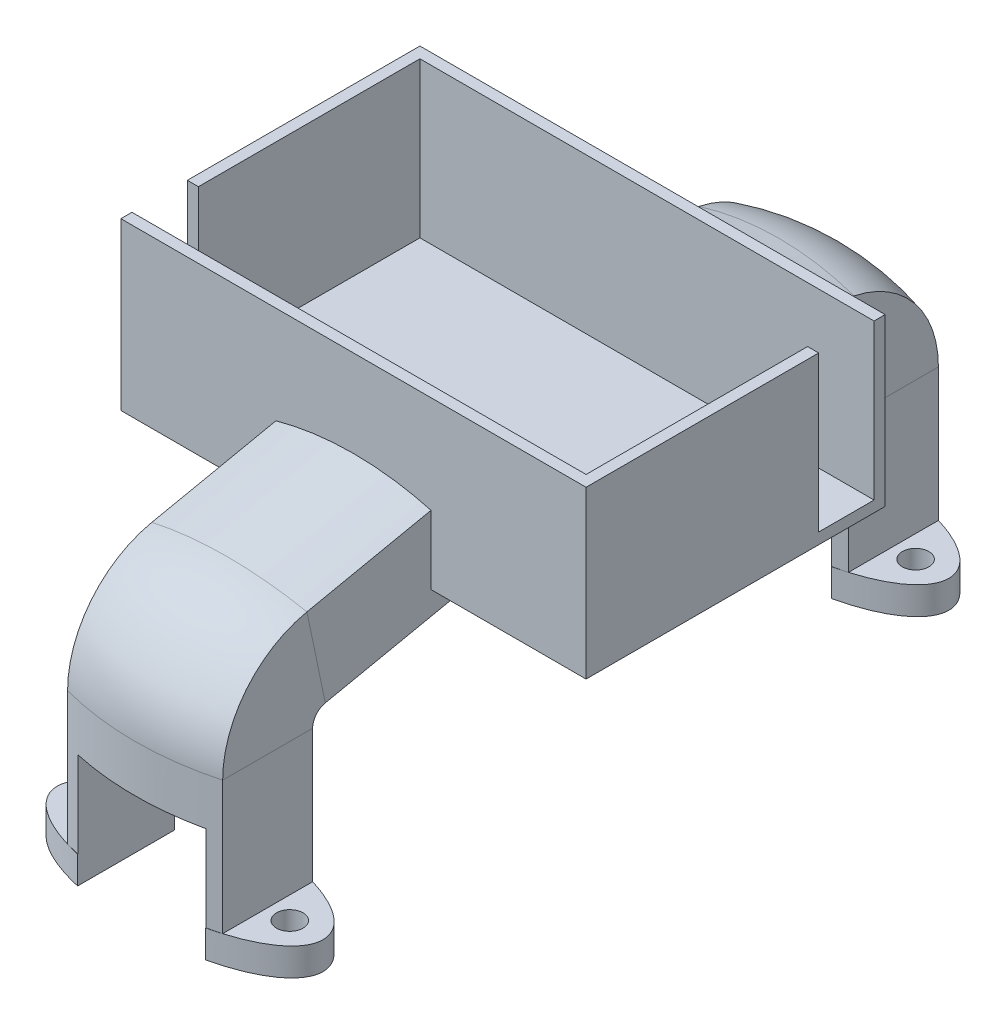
from build123d import *

# Parameters (mm, degrees)
SKETCH2_RX          = 12
SKETCH2_RY          = 5
BOSS_EXTRUDE1_DEPTH = 2.5
SKETCH3_R           = 1.2
CUT_EXTRUDE1_DEPTH  = 2.5
BOSS_EXTRUDE3_DEPTH = 9
SKETCH11_W          = 11.55
SKETCH11_H          = 10.25
CUT_EXTRUDE3_DEPTH  = 20
SKETCH12_RX         = 12
SKETCH12_RY         = 5
BOSS_EXTRUDE4_DEPTH = 2.5
SKETCH14_R          = 1.2
CUT_EXTRUDE4_DEPTH  = 2.5
BOSS_EXTRUDE5_DEPTH = 9
SKETCH17_W          = 42
SKETCH17_H          = 27
SKETCH17_W_2        = 40
SKETCH17_H_2        = 25
BOSS_EXTRUDE6_DEPTH = 15
SKETCH18_W          = 40
SKETCH18_H          = 25
BOSS_EXTRUDE7_DEPTH = 1.5
SKETCH19_W          = 11.55
SKETCH19_H          = 10.25
CUT_EXTRUDE5_DEPTH  = 13
SKETCH34_W          = 40
SKETCH34_H          = 25
CUT_EXTRUDE6_DEPTH  = 14
SKETCH35_W          = 1
SKETCH35_H          = 5
CUT_EXTRUDE7_DEPTH  = 14


with BuildPart() as part:
    # Sketch2 → Boss-Extrude1 (new body)
    with BuildSketch(Plane(origin=(0, 0, 0), x_dir=(1, 0, 0), z_dir=(0, 1, 0))):
        with Locations((0, 0)):
            Ellipse(SKETCH2_RX, SKETCH2_RY)
    extrude(amount=BOSS_EXTRUDE1_DEPTH)

    # Sketch3 → Cut-Extrude1 (cut)
    with BuildSketch(Plane(origin=(0, 2.5, 0), x_dir=(1, 0, 0), z_dir=(0, 1, 0))):
        with Locations(Location((9, 0, 0), (0, 0, 270))):
            Circle(SKETCH3_R)
        with Locations(Location((-9, 0, 0), (0, 0, 270))):
            Circle(SKETCH3_R)
    extrude(amount=-CUT_EXTRUDE1_DEPTH, mode=Mode.SUBTRACT)

    # Sketch10 → Boss-Extrude3 (add)
    with BuildSketch(Plane(origin=(0, 2.5, 0), x_dir=(1, 0, 0), z_dir=(0, 1, 0))):
        with BuildLine():
            Line((-7, -4.06116431), (-7, 4.06116431))
            ThreePointArc((-7, 4.06116431), (0, 4.987807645), (7, 4.06116431))
            Line((7, 4.06116431), (7, -4.06116431))
            ThreePointArc((7, -4.06116431), (0, -4.98780129), (-7, -4.06116431))
        make_face()
    extrude(amount=BOSS_EXTRUDE3_DEPTH)

    # Sketch11 → Cut-Extrude3 (cut)
    with BuildSketch(Plane.XY.offset(10)):
        with Locations((0, 5.125)):
            Rectangle(SKETCH11_W, SKETCH11_H)
    extrude(amount=-CUT_EXTRUDE3_DEPTH, mode=Mode.SUBTRACT)



with BuildPart() as body_2:
    # Sketch12 → Boss-Extrude4 (new body)
    with BuildSketch(Plane(origin=(0, 0, 0), x_dir=(1, 0, 0), z_dir=(0, 1, 0))):
        with Locations((0, 56.5)):
            Ellipse(SKETCH12_RX, SKETCH12_RY)
    extrude(amount=BOSS_EXTRUDE4_DEPTH)

    # Sketch14 → Cut-Extrude4 (cut)
    with BuildSketch(Plane(origin=(0, 2.5, 0), x_dir=(1, 0, 0), z_dir=(0, 1, 0))):
        with Locations(Location((9, 56.5, 0), (0, 0, 270))):
            Circle(SKETCH14_R)
        with Locations(Location((-9, 56.5, 0), (0, 0, 270))):
            Circle(SKETCH14_R)
    extrude(amount=-CUT_EXTRUDE4_DEPTH, mode=Mode.SUBTRACT)

    # Sketch16 → Boss-Extrude5 (add)
    with BuildSketch(Plane(origin=(0, 2.5, 0), x_dir=(1, 0, 0), z_dir=(0, 1, 0))):
        with BuildLine():
            Line((-7, 60.56116431), (-7, 52.43883569))
            ThreePointArc((-7, 52.43883569), (0, 51.499999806), (7, 52.43883569))
            Line((7, 52.43883569), (7, 60.56116431))
            ThreePointArc((7, 60.56116431), (0, 61.500000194), (-7, 60.56116431))
        make_face()
    extrude(amount=BOSS_EXTRUDE5_DEPTH)

    # Sketch19 → Cut-Extrude5 (cut)
    with BuildSketch(Plane.XY.offset(-50)):
        with Locations((0, 5.125)):
            Rectangle(SKETCH19_W, SKETCH19_H)
    extrude(amount=-CUT_EXTRUDE5_DEPTH, mode=Mode.SUBTRACT)



with BuildPart() as body_3:
    # Sketch17 → Boss-Extrude6 (new body)
    with BuildSketch(Plane(origin=(0, 20, 0), x_dir=(1, 0, 0), z_dir=(0, 1, 0))):
        with Locations((0, 28.25)):
            Rectangle(SKETCH17_W, SKETCH17_H)
        with Locations((0, 28.25)):
            Rectangle(SKETCH17_W_2, SKETCH17_H_2, mode=Mode.SUBTRACT)
    extrude(amount=BOSS_EXTRUDE6_DEPTH)

    # Sketch18 → Boss-Extrude7 (add)
    with BuildSketch(Plane(origin=(0, 20, 0), x_dir=(1, 0, 0), z_dir=(0, 1, 0))):
        with Locations((0, 28.25)):
            Rectangle(SKETCH18_W, SKETCH18_H)
    extrude(amount=BOSS_EXTRUDE7_DEPTH)


with BuildPart() as body_2_1:
    add(body_2.part)

    add(body_3.part)  # Sweep6 merges body 3
    # Sweep6: sweep along a path in Sketch21
    with BuildLine(Plane(origin=(0, 0, 0), x_dir=(0, 0, -1), z_dir=(1, 0, 0))) as sweep6_path:
        Line((56.5, 11.5), (56.5, 14.5))
        ThreePointArc((56.5, 14.5), (55.267760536, 17.969325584), (52.123192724, 19.884091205))
        Line((52.123192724, 19.884091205), (34.502530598, 23.559994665))
    # Sketch20 → Sweep6 (sweep)
    with BuildSketch(Plane(origin=(0, 11.5, 0), x_dir=(1, 0, 0), z_dir=(0, 1, 0))):
        with BuildLine():
            Line((-7, 60.56116431), (-7, 52.43883569))
            ThreePointArc((-7, 52.43883569), (0, 51.499999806), (7, 52.43883569))
            Line((7, 52.43883569), (7, 60.56116431))
            ThreePointArc((7, 60.56116431), (0, 61.500000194), (-7, 60.56116431))
        make_face()
    sweep(path=sweep6_path.line)


with BuildPart() as part_1:
    add(part.part)

    add(body_2_1.part)  # Sweep7 merges body 2
    # Sweep7: sweep along a path in Sketch33
    with BuildLine(Plane(origin=(0, 0, 0), x_dir=(0, 0, -1), z_dir=(1, 0, 0))) as sweep7_path:
        Line((21.997469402, 23.559994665), (4.376807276, 19.884091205))
        ThreePointArc((4.376807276, 19.884091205), (1.232239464, 17.969325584), (0, 14.5))
        Line((0, 14.5), (0, 11.5))
    # Sketch32 → Sweep7 (sweep)
    with BuildSketch(Plane(origin=(0, 11.5, 0), x_dir=(1, 0, 0), z_dir=(0, 1, 0))):
        with BuildLine():
            Line((-7, 4.06116431), (-7, -4.06116431))
            ThreePointArc((-7, -4.06116431), (0, -4.98780129), (7, -4.06116431))
            Line((7, -4.06116431), (7, 4.06116431))
            ThreePointArc((7, 4.06116431), (0, 4.987807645), (-7, 4.06116431))
        make_face()
    sweep(path=sweep7_path.line)

    # Sketch34 → Cut-Extrude6 (cut)
    with BuildSketch(Plane(origin=(0, 35, 0), x_dir=(1, 0, 0), z_dir=(0, 1, 0))):
        with Locations((0, 28.25)):
            Rectangle(SKETCH34_W, SKETCH34_H)
    extrude(amount=-CUT_EXTRUDE6_DEPTH, mode=Mode.SUBTRACT)

    # Sketch35 → Cut-Extrude7 (cut)
    with BuildSketch(Plane(origin=(0, 35, 0), x_dir=(1, 0, 0), z_dir=(0, 1, 0))):
        with Locations((-20.5, 18.25)):
            Rectangle(SKETCH35_W, SKETCH35_H)
        with Locations((20.5, 38.25)):
            Rectangle(SKETCH35_W, SKETCH35_H)
    extrude(amount=-CUT_EXTRUDE7_DEPTH, mode=Mode.SUBTRACT)


solid = part_1.part
